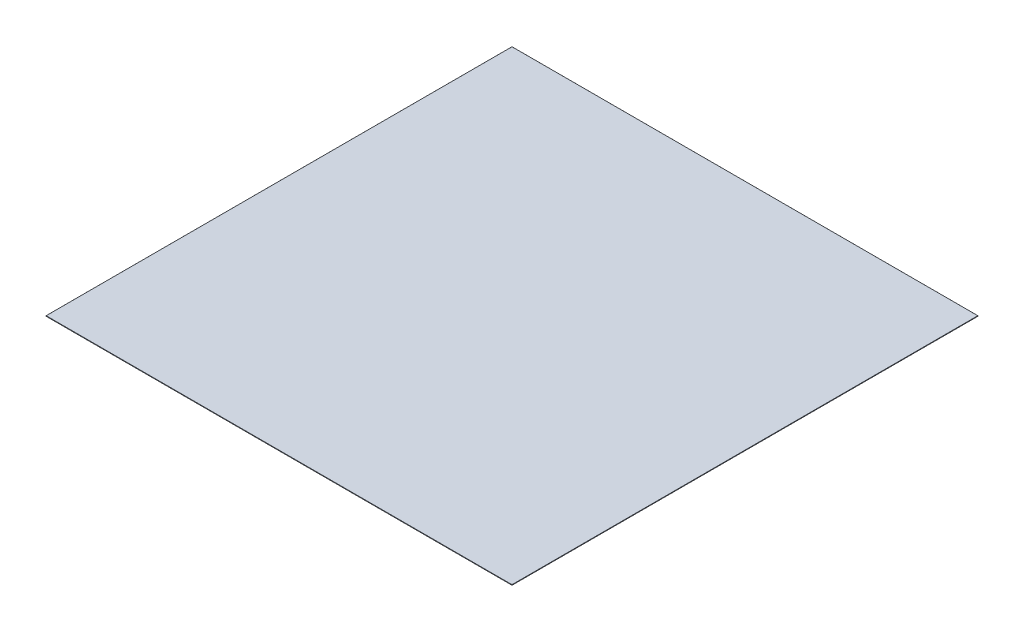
from build123d import *

# Parameters (mm, degrees)
SKIZZE1_W                       = 90
SKIZZE1_H                       = 90
AUFSATZ_LINEAR_AUSTRAGEN1_DEPTH = 0.05
VERRUNDUNG1_R                   = 0.02


with BuildPart() as part:
    # Skizze1 → Aufsatz-Linear austragen1 (new, symmetric)
    with BuildSketch(Plane(origin=(0, 0, 0), x_dir=(1, 0, 0), z_dir=(0, 1, 0))):
        Rectangle(SKIZZE1_W, SKIZZE1_H)
    extrude(amount=AUFSATZ_LINEAR_AUSTRAGEN1_DEPTH, both=True)

    # Verrundung1
    verrundung1_edges = [part.edges().sort_by_distance(p)[0] for p in [
        (45, 0.05, 0),
        (0, 0.05, -45),
        (-45, 0.05, 0),
        (0, -0.05, -45),
        (45, -0.05, 0),
        (0, -0.05, 45),
        (-45, -0.05, 0),
        (0, 0.05, 45),
    ]]
    fillet(verrundung1_edges, radius=VERRUNDUNG1_R)


solid = part.part
